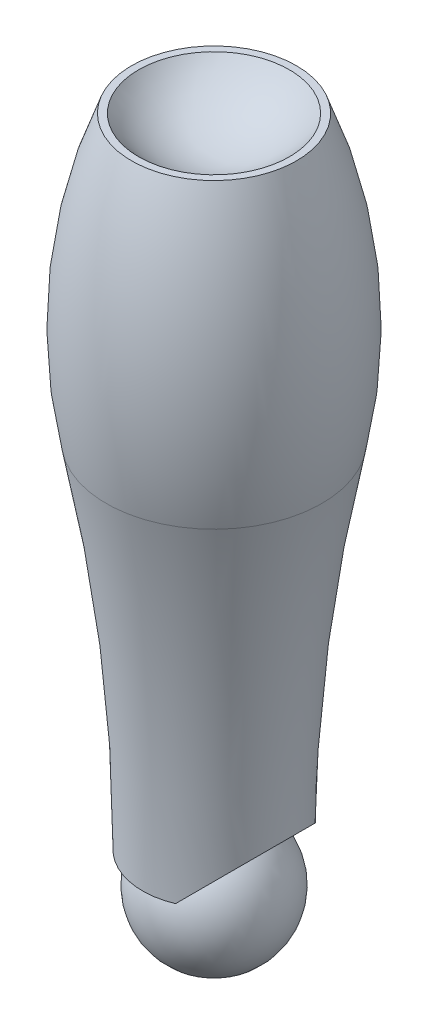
ISO-10303-21;
HEADER;
FILE_DESCRIPTION(('STEP AP214'),'2;1');
FILE_NAME('part.step','',(''),(''),'','','');
FILE_SCHEMA(('AUTOMOTIVE_DESIGN { 1 0 10303 214 1 1 1 1 }'));
ENDSEC;
DATA;
#1=APPLICATION_CONTEXT('core data for automotive mechanical design processes');
#2=APPLICATION_PROTOCOL_DEFINITION('international standard','automotive_design',2000,#1);
#3=PRODUCT_CONTEXT('',#1,'mechanical');
#4=PRODUCT('Part','Part','',(#3));
#5=PRODUCT_RELATED_PRODUCT_CATEGORY('part','',(#4));
#6=PRODUCT_DEFINITION_FORMATION('','',#4);
#7=PRODUCT_DEFINITION_CONTEXT('part definition',#1,'design');
#8=PRODUCT_DEFINITION('design','',#6,#7);
#9=PRODUCT_DEFINITION_SHAPE('','',#8);
#10=(LENGTH_UNIT() NAMED_UNIT(*) SI_UNIT(.MILLI.,.METRE.));
#11=(NAMED_UNIT(*) PLANE_ANGLE_UNIT() SI_UNIT($,.RADIAN.));
#12=(NAMED_UNIT(*) SI_UNIT($,.STERADIAN.) SOLID_ANGLE_UNIT());
#13=UNCERTAINTY_MEASURE_WITH_UNIT(LENGTH_MEASURE(1.E-05),#10,'distance_accuracy_value','');
#14=(GEOMETRIC_REPRESENTATION_CONTEXT(3) GLOBAL_UNCERTAINTY_ASSIGNED_CONTEXT((#13)) GLOBAL_UNIT_ASSIGNED_CONTEXT((#10,
#11,#12)) REPRESENTATION_CONTEXT('',''));
#15=CARTESIAN_POINT('',(0.,0.,0.));
#16=DIRECTION('',(0.,0.,1.));
#17=DIRECTION('',(1.,0.,0.));
#18=AXIS2_PLACEMENT_3D('',#15,#16,#17);
#19=CARTESIAN_POINT('',(37.3750000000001,0.,0.));
#20=DIRECTION('',(0.,-1.,0.));
#21=DIRECTION('',(0.,0.,-1.));
#22=AXIS2_PLACEMENT_3D('',#19,#20,#21);
#23=PLANE('',#22);
#24=DIRECTION('',(0.,0.,1.));
#25=VECTOR('',#24,1.);
#26=CARTESIAN_POINT('',(14.375,0.,0.));
#27=LINE('',#26,#25);
#28=CARTESIAN_POINT('',(14.3749999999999,1.11180492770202E-13,-34.5000000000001));
#29=VERTEX_POINT('',#28);
#30=CARTESIAN_POINT('',(14.3749999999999,0.,-26.9742353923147));
#31=VERTEX_POINT('',#30);
#32=EDGE_CURVE('E55',#29,#31,#27,.T.);
#33=ORIENTED_EDGE('',*,*,#32,.T.);
#34=CARTESIAN_POINT('',(0.,0.,0.));
#35=DIRECTION('',(0.,-1.,0.));
#36=DIRECTION('',(0.,0.,-1.));
#37=AXIS2_PLACEMENT_3D('',#34,#35,#36);
#38=CIRCLE('',#37,30.5655034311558);
#39=CARTESIAN_POINT('',(14.375,0.,26.9742353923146));
#40=VERTEX_POINT('',#39);
#41=EDGE_CURVE('E49',#31,#40,#38,.F.);
#42=ORIENTED_EDGE('',*,*,#41,.T.);
#43=CARTESIAN_POINT('',(14.3750000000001,1.13584475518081E-13,34.5));
#44=VERTEX_POINT('',#43);
#45=EDGE_CURVE('E65',#40,#44,#27,.T.);
#46=ORIENTED_EDGE('',*,*,#45,.T.);
#47=CARTESIAN_POINT('',(0.,1.11180492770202E-13,0.));
#48=DIRECTION('',(0.,-1.,0.));
#49=DIRECTION('',(0.,0.,-1.));
#50=AXIS2_PLACEMENT_3D('',#47,#48,#49);
#51=CIRCLE('',#50,37.375);
#52=EDGE_CURVE('E72',#44,#29,#51,.T.);
#53=ORIENTED_EDGE('',*,*,#52,.T.);
#54=EDGE_LOOP('',(#33,#42,#46,#53));
#55=FACE_BOUND('',#54,.T.);
#56=ADVANCED_FACE('F36',(#55),#23,.T.);
#57=CARTESIAN_POINT('',(7.18749999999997,-7.18749999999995,0.));
#58=DIRECTION('',(0.707106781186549,-0.707106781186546,0.));
#59=DIRECTION('',(0.707106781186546,0.707106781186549,0.));
#60=AXIS2_PLACEMENT_3D('',#57,#58,#59);
#61=PLANE('',#60);
#62=ORIENTED_EDGE('',*,*,#45,.F.);
#63=CARTESIAN_POINT('',(-0.812500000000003,-15.1875,0.));
#64=DIRECTION('',(0.707106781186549,-0.707106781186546,0.));
#65=DIRECTION('',(0.707106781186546,0.707106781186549,0.));
#66=AXIS2_PLACEMENT_3D('',#63,#64,#65);
#67=CIRCLE('',#66,34.4808597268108);
#68=EDGE_CURVE('E12',#40,#31,#67,.F.);
#69=ORIENTED_EDGE('',*,*,#68,.T.);
#70=ORIENTED_EDGE('',*,*,#32,.F.);
#71=CARTESIAN_POINT('',(14.3748000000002,-0.000199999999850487,34.5000833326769));
#72=CARTESIAN_POINT('',(14.9074073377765,0.532407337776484,34.2781521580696));
#73=CARTESIAN_POINT('',(15.4373607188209,1.06236071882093,34.0433884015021));
#74=CARTESIAN_POINT('',(16.4911730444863,2.11617304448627,33.5476403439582));
#75=CARTESIAN_POINT('',(17.015031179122,2.64003117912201,33.2866526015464));
#76=CARTESIAN_POINT('',(18.0567648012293,3.6817648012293,32.7374115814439));
#77=CARTESIAN_POINT('',(18.5746262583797,4.19962625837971,32.4491049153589));
#78=CARTESIAN_POINT('',(19.6022540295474,5.22725402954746,31.8451203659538));
#79=CARTESIAN_POINT('',(20.1120206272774,5.73702062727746,31.5294434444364));
#80=CARTESIAN_POINT('',(21.6394574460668,7.26445744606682,30.5326895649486));
#81=CARTESIAN_POINT('',(22.643213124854,8.26821312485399,29.808180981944));
#82=CARTESIAN_POINT('',(24.602043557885,10.2270435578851,28.2395588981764));
#83=CARTESIAN_POINT('',(25.5571601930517,11.1821601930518,27.3955507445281));
#84=CARTESIAN_POINT('',(27.1055306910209,12.730530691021,25.876801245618));
#85=CARTESIAN_POINT('',(27.7155500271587,13.3405500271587,25.2361316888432));
#86=CARTESIAN_POINT('',(28.9026070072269,14.527607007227,23.8960081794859));
#87=CARTESIAN_POINT('',(29.4796440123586,15.1046440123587,23.1965530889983));
#88=CARTESIAN_POINT('',(30.5926273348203,16.2176273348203,21.7406293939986));
#89=CARTESIAN_POINT('',(31.128721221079,16.7537212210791,20.9843871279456));
#90=CARTESIAN_POINT('',(32.1555505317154,17.7805505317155,19.4120705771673));
#91=CARTESIAN_POINT('',(32.6462795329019,18.271279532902,18.5959878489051));
#92=CARTESIAN_POINT('',(33.4846952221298,19.1096952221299,17.0687191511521));
#93=CARTESIAN_POINT('',(33.8416957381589,19.466695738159,16.3677504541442));
#94=CARTESIAN_POINT('',(34.5164238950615,20.1414238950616,14.9293640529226));
#95=CARTESIAN_POINT('',(34.8341730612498,20.4591730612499,14.191966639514));
#96=CARTESIAN_POINT('',(35.4260404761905,21.0510404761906,12.6824908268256));
#97=CARTESIAN_POINT('',(35.7001437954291,21.3251437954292,11.9104006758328));
#98=CARTESIAN_POINT('',(36.199898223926,21.8248982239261,10.335333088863));
#99=CARTESIAN_POINT('',(36.4255489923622,22.0505489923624,9.53235543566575));
#100=CARTESIAN_POINT('',(36.8257000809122,22.4507000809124,7.89334374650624));
#101=CARTESIAN_POINT('',(36.9997379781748,22.624737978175,7.05708278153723));
#102=CARTESIAN_POINT('',(37.2901047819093,22.9151047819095,5.36465407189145));
#103=CARTESIAN_POINT('',(37.4064334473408,23.031433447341,4.50848624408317));
#104=CARTESIAN_POINT('',(37.5784848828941,23.2034848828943,2.78463885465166));
#105=CARTESIAN_POINT('',(37.6342515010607,23.2592515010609,1.9169680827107));
#106=CARTESIAN_POINT('',(37.6838854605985,23.3088854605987,0.178143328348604));
#107=CARTESIAN_POINT('',(37.6777609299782,23.3027609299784,-0.69301018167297));
#108=CARTESIAN_POINT('',(37.6090022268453,23.2340022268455,-2.30831364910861));
#109=CARTESIAN_POINT('',(37.5543976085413,23.1793976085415,-3.05317318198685));
#110=CARTESIAN_POINT('',(37.4006197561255,23.0256197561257,-4.53354535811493));
#111=CARTESIAN_POINT('',(37.3014516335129,22.9264516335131,-5.26905906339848));
#112=CARTESIAN_POINT('',(37.060312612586,22.6853126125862,-6.72595419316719));
#113=CARTESIAN_POINT('',(36.9183362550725,22.5433362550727,-7.44733380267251));
#114=CARTESIAN_POINT('',(36.5939588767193,22.2189588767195,-8.87165912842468));
#115=CARTESIAN_POINT('',(36.4115555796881,22.0365555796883,-9.57460380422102));
#116=CARTESIAN_POINT('',(36.0057681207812,21.6307681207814,-10.9700374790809));
#117=CARTESIAN_POINT('',(35.7817533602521,21.4067533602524,-11.6621586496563));
#118=CARTESIAN_POINT('',(35.2979947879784,20.9229947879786,-13.0208560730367));
#119=CARTESIAN_POINT('',(35.0382517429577,20.6632517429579,-13.687432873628));
#120=CARTESIAN_POINT('',(34.4863156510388,20.111315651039,-14.9928807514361));
#121=CARTESIAN_POINT('',(34.1941291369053,19.8191291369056,-15.6317573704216));
#122=CARTESIAN_POINT('',(33.5803387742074,19.2053387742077,-16.8807449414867));
#123=CARTESIAN_POINT('',(33.2587284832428,18.883728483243,-17.490849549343));
#124=CARTESIAN_POINT('',(32.6664793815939,18.2914793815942,-18.543847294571));
#125=CARTESIAN_POINT('',(32.4012167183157,18.0262167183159,-18.9928232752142));
#126=CARTESIAN_POINT('',(31.8564287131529,17.4814287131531,-19.8729430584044));
#127=CARTESIAN_POINT('',(31.5769057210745,17.2019057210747,-20.3040897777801));
#128=CARTESIAN_POINT('',(30.7184140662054,16.3434140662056,-21.5711878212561));
#129=CARTESIAN_POINT('',(30.1196601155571,15.7446601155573,-22.3805549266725));
#130=CARTESIAN_POINT('',(28.8754345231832,14.5004345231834,-23.9321518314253));
#131=CARTESIAN_POINT('',(28.2297547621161,13.8547547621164,-24.6740449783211));
#132=CARTESIAN_POINT('',(26.901529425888,12.5265294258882,-26.0880892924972));
#133=CARTESIAN_POINT('',(26.2189878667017,11.8439878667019,-26.7602480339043));
#134=CARTESIAN_POINT('',(24.657140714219,10.2821407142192,-28.1888660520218));
#135=CARTESIAN_POINT('',(23.7696329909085,9.39463299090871,-28.9273779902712));
#136=CARTESIAN_POINT('',(21.9566053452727,7.58160534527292,-30.305590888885));
#137=CARTESIAN_POINT('',(21.0310656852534,6.65606568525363,-30.945239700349));
#138=CARTESIAN_POINT('',(19.6266293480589,5.25162934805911,-31.8294435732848));
#139=CARTESIAN_POINT('',(19.1588883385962,4.78388833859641,-32.1100474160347));
#140=CARTESIAN_POINT('',(18.2168830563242,3.84188305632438,-32.6485638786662));
#141=CARTESIAN_POINT('',(17.7426186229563,3.3676186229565,-32.9064759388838));
#142=CARTESIAN_POINT('',(16.7889780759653,2.41397807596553,-33.3996892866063));
#143=CARTESIAN_POINT('',(16.3096096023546,1.93460960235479,-33.6350201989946));
#144=CARTESIAN_POINT('',(15.3458334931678,0.97083349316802,-34.0838320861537));
#145=CARTESIAN_POINT('',(14.861426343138,0.486426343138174,-34.2973151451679));
#146=CARTESIAN_POINT('',(14.3747999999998,-0.000199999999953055,-34.500083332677));
#147=B_SPLINE_CURVE_WITH_KNOTS('',3,(#71,#72,#73,#74,#75,#76,#77,#78,#79,#80,#81,#82,#83,#84,
#85,#86,#87,#88,#89,#90,#91,#92,#93,#94,#95,#96,#97,#98,#99,#100,#101,#102,#103,#104,#105,#106,
#107,#108,#109,#110,#111,#112,#113,#114,#115,#116,#117,#118,#119,#120,#121,#122,#123,#124,#125,
#126,#127,#128,#129,#130,#131,#132,#133,#134,#135,#136,#137,#138,#139,#140,#141,#142,#143,#144,
#145,#146),.UNSPECIFIED.,.F.,.F.,(4,2,2,2,2,2,2,2,2,2,2,2,2,2,2,2,2,2,2,2,2,2,2,2,2,2,2,2,2,2,2,
2,2,2,2,2,2,4),(0.,2.35562822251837,4.71156598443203,7.07220675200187,9.43276459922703,
14.2082367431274,18.9795248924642,22.2009605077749,25.4224584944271,28.6317361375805,
31.8414674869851,34.4307429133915,37.0185920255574,39.6073244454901,42.1960750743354,
44.8073635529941,47.4186629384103,50.0280704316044,52.6371352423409,54.8810132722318,
57.1246339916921,59.3685409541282,61.6125742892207,63.8938958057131,66.1751683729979,
68.4559824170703,70.7372970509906,72.4918825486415,74.246179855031,77.7557023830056,
81.2818711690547,84.8076565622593,89.1716371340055,93.5379118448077,95.6931993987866,
97.8485400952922,100.001013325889,102.153281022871),.UNSPECIFIED.);
#148=EDGE_CURVE('E43',#44,#29,#147,.T.);
#149=ORIENTED_EDGE('',*,*,#148,.F.);
#150=EDGE_LOOP('',(#62,#69,#70,#149));
#151=FACE_BOUND('',#150,.T.);
#152=ADVANCED_FACE('F67',(#151),#61,.T.);
#153=CARTESIAN_POINT('',(0.,0.,0.));
#154=DIRECTION('',(0.,-1.,0.));
#155=DIRECTION('',(0.,0.,-1.));
#156=AXIS2_PLACEMENT_3D('',#153,#154,#155);
#157=TOROIDAL_SURFACE('',#156,945.232619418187,907.857619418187);
#158=CARTESIAN_POINT('',(0.,185.,0.));
#159=DIRECTION('',(0.,-1.,0.));
#160=DIRECTION('',(0.,0.,-1.));
#161=AXIS2_PLACEMENT_3D('',#158,#159,#160);
#162=CIRCLE('',#161,56.4241714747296);
#163=CARTESIAN_POINT('',(0.,185.,-56.4241714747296));
#164=VERTEX_POINT('',#163);
#165=EDGE_CURVE('E74',#164,#164,#162,.T.);
#166=ORIENTED_EDGE('',*,*,#165,.T.);
#167=EDGE_LOOP('',(#166));
#168=FACE_BOUND('',#167,.T.);
#169=ORIENTED_EDGE('',*,*,#52,.F.);
#170=ORIENTED_EDGE('',*,*,#148,.T.);
#171=EDGE_LOOP('',(#169,#170));
#172=FACE_BOUND('',#171,.T.);
#173=ADVANCED_FACE('F86',(#168,#172),#157,.F.);
#174=CARTESIAN_POINT('',(0.,333.5,0.));
#175=DIRECTION('',(0.,1.,0.));
#176=DIRECTION('',(0.,0.,1.));
#177=AXIS2_PLACEMENT_3D('',#174,#175,#176);
#178=PLANE('',#177);
#179=CARTESIAN_POINT('',(0.,333.5,0.));
#180=DIRECTION('',(0.,-1.,0.));
#181=DIRECTION('',(0.,0.,-1.));
#182=AXIS2_PLACEMENT_3D('',#179,#180,#181);
#183=CIRCLE('',#182,43.125);
#184=CARTESIAN_POINT('',(0.,333.5,-43.125));
#185=VERTEX_POINT('',#184);
#186=EDGE_CURVE('E77',#185,#185,#183,.T.);
#187=ORIENTED_EDGE('',*,*,#186,.F.);
#188=EDGE_LOOP('',(#187));
#189=FACE_BOUND('',#188,.T.);
#190=CARTESIAN_POINT('',(0.,333.5,0.));
#191=DIRECTION('',(0.,1.,0.));
#192=DIRECTION('',(0.,0.,1.));
#193=AXIS2_PLACEMENT_3D('',#190,#191,#192);
#194=CIRCLE('',#193,39.436024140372);
#195=CARTESIAN_POINT('',(0.,333.5,39.436024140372));
#196=VERTEX_POINT('',#195);
#197=EDGE_CURVE('E70',#196,#196,#194,.F.);
#198=ORIENTED_EDGE('',*,*,#197,.T.);
#199=EDGE_LOOP('',(#198));
#200=FACE_BOUND('',#199,.T.);
#201=ADVANCED_FACE('F101',(#189,#200),#178,.T.);
#202=CARTESIAN_POINT('',(0.,237.329875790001,0.));
#203=DIRECTION('',(0.,-1.,0.));
#204=DIRECTION('',(0.,0.,-1.));
#205=AXIS2_PLACEMENT_3D('',#202,#203,#204);
#206=DEGENERATE_TOROIDAL_SURFACE('',#205,194.987913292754,256.800413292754,.F.);
#207=ORIENTED_EDGE('',*,*,#186,.T.);
#208=EDGE_LOOP('',(#207));
#209=FACE_BOUND('',#208,.T.);
#210=ORIENTED_EDGE('',*,*,#165,.F.);
#211=EDGE_LOOP('',(#210));
#212=FACE_BOUND('',#211,.T.);
#213=ADVANCED_FACE('F95',(#209,#212),#206,.F.);
#214=CARTESIAN_POINT('',(0.,362.38,0.));
#215=DIRECTION('',(0.,-1.,0.));
#216=DIRECTION('',(-1.,0.,0.));
#217=AXIS2_PLACEMENT_3D('',#214,#215,#216);
#218=SPHERICAL_SURFACE('',#217,48.88);
#219=ORIENTED_EDGE('',*,*,#197,.F.);
#220=EDGE_LOOP('',(#219));
#221=FACE_BOUND('',#220,.T.);
#222=ADVANCED_FACE('F93',(#221),#218,.F.);
#223=CARTESIAN_POINT('',(0.,-16.,0.));
#224=DIRECTION('',(0.,-1.,0.));
#225=DIRECTION('',(-1.,0.,0.));
#226=AXIS2_PLACEMENT_3D('',#223,#224,#225);
#227=SPHERICAL_SURFACE('',#226,34.5);
#228=ORIENTED_EDGE('',*,*,#41,.F.);
#229=ORIENTED_EDGE('',*,*,#68,.F.);
#230=EDGE_LOOP('',(#228,#229));
#231=FACE_BOUND('',#230,.T.);
#232=ADVANCED_FACE('F61',(#231),#227,.T.);
#233=CLOSED_SHELL('',(#56,#152,#173,#201,#213,#222,#232));
#234=MANIFOLD_SOLID_BREP('B2',#233);
#235=ADVANCED_BREP_SHAPE_REPRESENTATION('',(#18,#234),#14);
#236=SHAPE_DEFINITION_REPRESENTATION(#9,#235);
ENDSEC;
END-ISO-10303-21;
